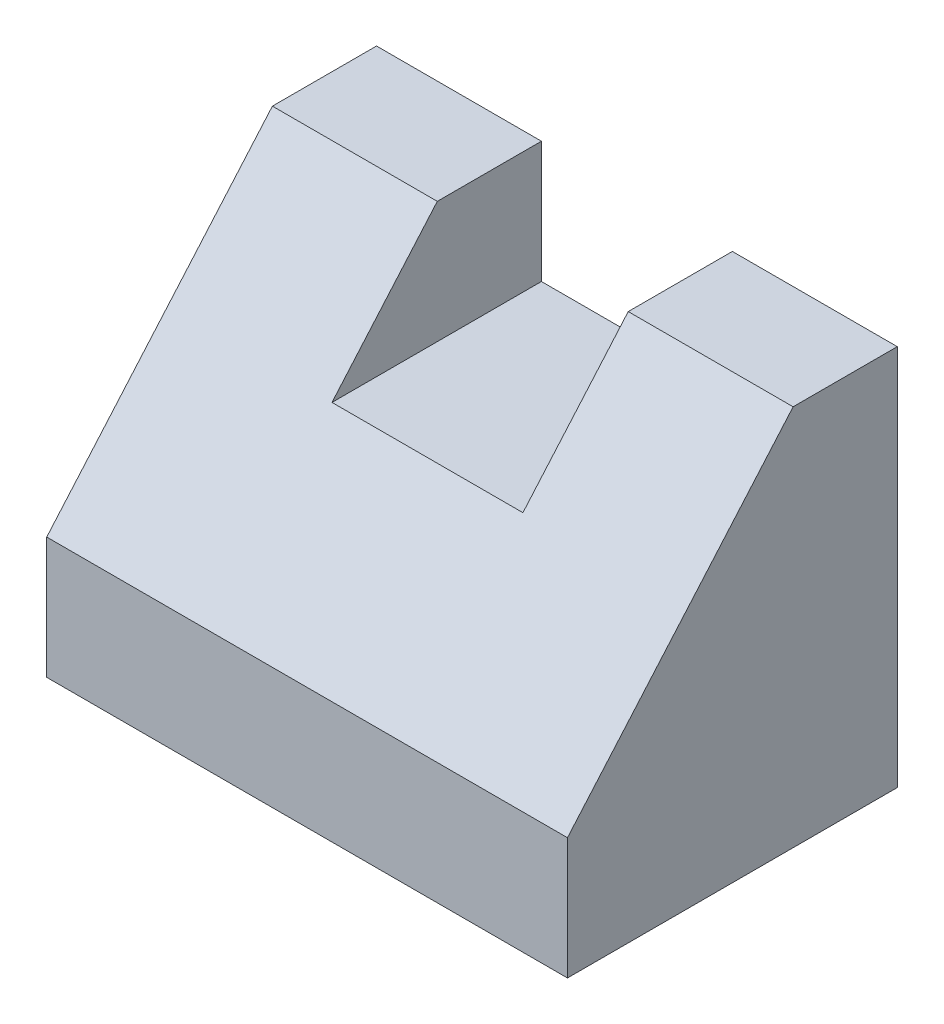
ISO-10303-21;
HEADER;
FILE_DESCRIPTION(('STEP AP214'),'2;1');
FILE_NAME('part.step','',(''),(''),'','','');
FILE_SCHEMA(('AUTOMOTIVE_DESIGN { 1 0 10303 214 1 1 1 1 }'));
ENDSEC;
DATA;
#1=APPLICATION_CONTEXT('core data for automotive mechanical design processes');
#2=APPLICATION_PROTOCOL_DEFINITION('international standard','automotive_design',2000,#1);
#3=PRODUCT_CONTEXT('',#1,'mechanical');
#4=PRODUCT('Part','Part','',(#3));
#5=PRODUCT_RELATED_PRODUCT_CATEGORY('part','',(#4));
#6=PRODUCT_DEFINITION_FORMATION('','',#4);
#7=PRODUCT_DEFINITION_CONTEXT('part definition',#1,'design');
#8=PRODUCT_DEFINITION('design','',#6,#7);
#9=PRODUCT_DEFINITION_SHAPE('','',#8);
#10=(LENGTH_UNIT() NAMED_UNIT(*) SI_UNIT(.MILLI.,.METRE.));
#11=(NAMED_UNIT(*) PLANE_ANGLE_UNIT() SI_UNIT($,.RADIAN.));
#12=(NAMED_UNIT(*) SI_UNIT($,.STERADIAN.) SOLID_ANGLE_UNIT());
#13=UNCERTAINTY_MEASURE_WITH_UNIT(LENGTH_MEASURE(1.E-05),#10,'distance_accuracy_value','');
#14=(GEOMETRIC_REPRESENTATION_CONTEXT(3) GLOBAL_UNCERTAINTY_ASSIGNED_CONTEXT((#13)) GLOBAL_UNIT_ASSIGNED_CONTEXT((#10,
#11,#12)) REPRESENTATION_CONTEXT('',''));
#15=CARTESIAN_POINT('',(0.,0.,0.));
#16=DIRECTION('',(0.,0.,1.));
#17=DIRECTION('',(1.,0.,0.));
#18=AXIS2_PLACEMENT_3D('',#15,#16,#17);
#19=CARTESIAN_POINT('',(15.,0.,6.));
#20=DIRECTION('',(0.,-1.,0.));
#21=DIRECTION('',(0.,0.,-1.));
#22=AXIS2_PLACEMENT_3D('',#19,#20,#21);
#23=PLANE('',#22);
#24=DIRECTION('',(-1.,0.,0.));
#25=VECTOR('',#24,1.);
#26=CARTESIAN_POINT('',(15.,0.,0.));
#27=LINE('',#26,#25);
#28=CARTESIAN_POINT('',(15.,0.,0.));
#29=VERTEX_POINT('',#28);
#30=CARTESIAN_POINT('',(5.5,0.,0.));
#31=VERTEX_POINT('',#30);
#32=EDGE_CURVE('E131',#29,#31,#27,.T.);
#33=ORIENTED_EDGE('',*,*,#32,.T.);
#34=DIRECTION('',(0.,0.,1.));
#35=VECTOR('',#34,1.);
#36=CARTESIAN_POINT('',(5.5,0.,6.));
#37=LINE('',#36,#35);
#38=CARTESIAN_POINT('',(5.5,0.,6.));
#39=VERTEX_POINT('',#38);
#40=EDGE_CURVE('E123',#31,#39,#37,.T.);
#41=ORIENTED_EDGE('',*,*,#40,.T.);
#42=DIRECTION('',(-1.,0.,0.));
#43=VECTOR('',#42,1.);
#44=CARTESIAN_POINT('',(15.,0.,6.));
#45=LINE('',#44,#43);
#46=CARTESIAN_POINT('',(15.,0.,6.));
#47=VERTEX_POINT('',#46);
#48=EDGE_CURVE('E39',#47,#39,#45,.T.);
#49=ORIENTED_EDGE('',*,*,#48,.F.);
#50=DIRECTION('',(0.,0.,1.));
#51=VECTOR('',#50,1.);
#52=CARTESIAN_POINT('',(15.,0.,6.));
#53=LINE('',#52,#51);
#54=EDGE_CURVE('E130',#29,#47,#53,.T.);
#55=ORIENTED_EDGE('',*,*,#54,.F.);
#56=EDGE_LOOP('',(#33,#41,#49,#55));
#57=FACE_BOUND('',#56,.T.);
#58=ADVANCED_FACE('F31',(#57),#23,.F.);
#59=CARTESIAN_POINT('',(-5.5,0.,6.));
#60=VERTEX_POINT('',#59);
#61=CARTESIAN_POINT('',(-15.,0.,6.));
#62=VERTEX_POINT('',#61);
#63=EDGE_CURVE('E135',#60,#62,#45,.T.);
#64=ORIENTED_EDGE('',*,*,#63,.F.);
#65=DIRECTION('',(0.,0.,-1.));
#66=VECTOR('',#65,1.);
#67=CARTESIAN_POINT('',(-5.5,0.,6.));
#68=LINE('',#67,#66);
#69=CARTESIAN_POINT('',(-5.5,0.,0.));
#70=VERTEX_POINT('',#69);
#71=EDGE_CURVE('E173',#60,#70,#68,.T.);
#72=ORIENTED_EDGE('',*,*,#71,.T.);
#73=CARTESIAN_POINT('',(-15.,0.,0.));
#74=VERTEX_POINT('',#73);
#75=EDGE_CURVE('E80',#70,#74,#27,.T.);
#76=ORIENTED_EDGE('',*,*,#75,.T.);
#77=DIRECTION('',(0.,0.,1.));
#78=VECTOR('',#77,1.);
#79=CARTESIAN_POINT('',(-15.,0.,6.));
#80=LINE('',#79,#78);
#81=EDGE_CURVE('E120',#74,#62,#80,.T.);
#82=ORIENTED_EDGE('',*,*,#81,.T.);
#83=EDGE_LOOP('',(#64,#72,#76,#82));
#84=FACE_BOUND('',#83,.T.);
#85=ADVANCED_FACE('F33',(#84),#23,.F.);
#86=CARTESIAN_POINT('',(15.,-15.,19.));
#87=DIRECTION('',(0.,-0.654930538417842,-0.755689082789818));
#88=DIRECTION('',(0.,0.755689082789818,-0.654930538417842));
#89=AXIS2_PLACEMENT_3D('',#86,#87,#88);
#90=PLANE('',#89);
#91=ORIENTED_EDGE('',*,*,#48,.T.);
#92=DIRECTION('',(0.,-0.755689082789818,0.654930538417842));
#93=VECTOR('',#92,1.);
#94=CARTESIAN_POINT('',(5.5,-15.,19.));
#95=LINE('',#94,#93);
#96=CARTESIAN_POINT('',(5.5,-7.,12.0666666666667));
#97=VERTEX_POINT('',#96);
#98=EDGE_CURVE('E171',#39,#97,#95,.T.);
#99=ORIENTED_EDGE('',*,*,#98,.T.);
#100=DIRECTION('',(-1.,0.,0.));
#101=VECTOR('',#100,1.);
#102=CARTESIAN_POINT('',(15.,-7.,12.0666666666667));
#103=LINE('',#102,#101);
#104=CARTESIAN_POINT('',(-5.5,-7.,12.0666666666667));
#105=VERTEX_POINT('',#104);
#106=EDGE_CURVE('E179',#97,#105,#103,.T.);
#107=ORIENTED_EDGE('',*,*,#106,.T.);
#108=DIRECTION('',(0.,0.755689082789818,-0.654930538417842));
#109=VECTOR('',#108,1.);
#110=CARTESIAN_POINT('',(-5.5,-15.,19.));
#111=LINE('',#110,#109);
#112=EDGE_CURVE('E145',#105,#60,#111,.T.);
#113=ORIENTED_EDGE('',*,*,#112,.T.);
#114=ORIENTED_EDGE('',*,*,#63,.T.);
#115=DIRECTION('',(0.,-0.755689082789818,0.654930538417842));
#116=VECTOR('',#115,1.);
#117=CARTESIAN_POINT('',(-15.,-15.,19.));
#118=LINE('',#117,#116);
#119=CARTESIAN_POINT('',(-15.,-15.,19.));
#120=VERTEX_POINT('',#119);
#121=EDGE_CURVE('E122',#62,#120,#118,.T.);
#122=ORIENTED_EDGE('',*,*,#121,.T.);
#123=DIRECTION('',(-1.,0.,0.));
#124=VECTOR('',#123,1.);
#125=CARTESIAN_POINT('',(15.,-15.,19.));
#126=LINE('',#125,#124);
#127=CARTESIAN_POINT('',(15.,-15.,19.));
#128=VERTEX_POINT('',#127);
#129=EDGE_CURVE('E111',#128,#120,#126,.T.);
#130=ORIENTED_EDGE('',*,*,#129,.F.);
#131=DIRECTION('',(0.,-0.755689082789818,0.654930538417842));
#132=VECTOR('',#131,1.);
#133=CARTESIAN_POINT('',(15.,-15.,19.));
#134=LINE('',#133,#132);
#135=EDGE_CURVE('E89',#47,#128,#134,.T.);
#136=ORIENTED_EDGE('',*,*,#135,.F.);
#137=EDGE_LOOP('',(#91,#99,#107,#113,#114,#122,#130,#136));
#138=FACE_BOUND('',#137,.T.);
#139=ADVANCED_FACE('F141',(#138),#90,.F.);
#140=CARTESIAN_POINT('',(15.,-22.,19.));
#141=DIRECTION('',(0.,0.,-1.));
#142=DIRECTION('',(0.,1.,0.));
#143=AXIS2_PLACEMENT_3D('',#140,#141,#142);
#144=PLANE('',#143);
#145=DIRECTION('',(0.,-1.,0.));
#146=VECTOR('',#145,1.);
#147=CARTESIAN_POINT('',(-15.,-22.,19.));
#148=LINE('',#147,#146);
#149=CARTESIAN_POINT('',(-15.,-22.,19.));
#150=VERTEX_POINT('',#149);
#151=EDGE_CURVE('E108',#120,#150,#148,.T.);
#152=ORIENTED_EDGE('',*,*,#151,.T.);
#153=DIRECTION('',(-1.,0.,0.));
#154=VECTOR('',#153,1.);
#155=CARTESIAN_POINT('',(15.,-22.,19.));
#156=LINE('',#155,#154);
#157=CARTESIAN_POINT('',(15.,-22.,19.));
#158=VERTEX_POINT('',#157);
#159=EDGE_CURVE('E105',#158,#150,#156,.T.);
#160=ORIENTED_EDGE('',*,*,#159,.F.);
#161=DIRECTION('',(0.,-1.,0.));
#162=VECTOR('',#161,1.);
#163=CARTESIAN_POINT('',(15.,-22.,19.));
#164=LINE('',#163,#162);
#165=EDGE_CURVE('E95',#128,#158,#164,.T.);
#166=ORIENTED_EDGE('',*,*,#165,.F.);
#167=ORIENTED_EDGE('',*,*,#129,.T.);
#168=EDGE_LOOP('',(#152,#160,#166,#167));
#169=FACE_BOUND('',#168,.T.);
#170=ADVANCED_FACE('F106',(#169),#144,.F.);
#171=CARTESIAN_POINT('',(15.,-22.,0.));
#172=DIRECTION('',(0.,1.,0.));
#173=DIRECTION('',(0.,0.,1.));
#174=AXIS2_PLACEMENT_3D('',#171,#172,#173);
#175=PLANE('',#174);
#176=DIRECTION('',(0.,0.,-1.));
#177=VECTOR('',#176,1.);
#178=CARTESIAN_POINT('',(-15.,-22.,0.));
#179=LINE('',#178,#177);
#180=CARTESIAN_POINT('',(-15.,-22.,0.));
#181=VERTEX_POINT('',#180);
#182=EDGE_CURVE('E126',#150,#181,#179,.T.);
#183=ORIENTED_EDGE('',*,*,#182,.T.);
#184=DIRECTION('',(-1.,0.,0.));
#185=VECTOR('',#184,1.);
#186=CARTESIAN_POINT('',(15.,-22.,0.));
#187=LINE('',#186,#185);
#188=CARTESIAN_POINT('',(15.,-22.,0.));
#189=VERTEX_POINT('',#188);
#190=EDGE_CURVE('E112',#189,#181,#187,.T.);
#191=ORIENTED_EDGE('',*,*,#190,.F.);
#192=DIRECTION('',(0.,0.,-1.));
#193=VECTOR('',#192,1.);
#194=CARTESIAN_POINT('',(15.,-22.,0.));
#195=LINE('',#194,#193);
#196=EDGE_CURVE('E99',#158,#189,#195,.T.);
#197=ORIENTED_EDGE('',*,*,#196,.F.);
#198=ORIENTED_EDGE('',*,*,#159,.T.);
#199=EDGE_LOOP('',(#183,#191,#197,#198));
#200=FACE_BOUND('',#199,.T.);
#201=ADVANCED_FACE('F114',(#200),#175,.F.);
#202=CARTESIAN_POINT('',(15.,0.,0.));
#203=DIRECTION('',(0.,0.,1.));
#204=DIRECTION('',(0.,-1.,0.));
#205=AXIS2_PLACEMENT_3D('',#202,#203,#204);
#206=PLANE('',#205);
#207=DIRECTION('',(-1.,0.,0.));
#208=VECTOR('',#207,1.);
#209=CARTESIAN_POINT('',(5.5,-7.,0.));
#210=LINE('',#209,#208);
#211=CARTESIAN_POINT('',(5.5,-7.,0.));
#212=VERTEX_POINT('',#211);
#213=CARTESIAN_POINT('',(-5.5,-7.,0.));
#214=VERTEX_POINT('',#213);
#215=EDGE_CURVE('E166',#212,#214,#210,.T.);
#216=ORIENTED_EDGE('',*,*,#215,.F.);
#217=DIRECTION('',(0.,1.,0.));
#218=VECTOR('',#217,1.);
#219=CARTESIAN_POINT('',(5.5,0.,0.));
#220=LINE('',#219,#218);
#221=EDGE_CURVE('E11',#212,#31,#220,.T.);
#222=ORIENTED_EDGE('',*,*,#221,.T.);
#223=ORIENTED_EDGE('',*,*,#32,.F.);
#224=DIRECTION('',(0.,1.,0.));
#225=VECTOR('',#224,1.);
#226=CARTESIAN_POINT('',(15.,0.,0.));
#227=LINE('',#226,#225);
#228=EDGE_CURVE('E55',#189,#29,#227,.T.);
#229=ORIENTED_EDGE('',*,*,#228,.F.);
#230=ORIENTED_EDGE('',*,*,#190,.T.);
#231=DIRECTION('',(0.,1.,0.));
#232=VECTOR('',#231,1.);
#233=CARTESIAN_POINT('',(-15.,0.,0.));
#234=LINE('',#233,#232);
#235=EDGE_CURVE('E128',#181,#74,#234,.T.);
#236=ORIENTED_EDGE('',*,*,#235,.T.);
#237=ORIENTED_EDGE('',*,*,#75,.F.);
#238=DIRECTION('',(0.,1.,0.));
#239=VECTOR('',#238,1.);
#240=CARTESIAN_POINT('',(-5.5,2.26628352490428,0.));
#241=LINE('',#240,#239);
#242=EDGE_CURVE('E183',#214,#70,#241,.T.);
#243=ORIENTED_EDGE('',*,*,#242,.F.);
#244=EDGE_LOOP('',(#216,#222,#223,#229,#230,#236,#237,#243));
#245=FACE_BOUND('',#244,.T.);
#246=ADVANCED_FACE('F164',(#245),#206,.F.);
#247=CARTESIAN_POINT('',(15.,0.,0.));
#248=DIRECTION('',(-1.,0.,0.));
#249=DIRECTION('',(0.,0.,1.));
#250=AXIS2_PLACEMENT_3D('',#247,#248,#249);
#251=PLANE('',#250);
#252=ORIENTED_EDGE('',*,*,#54,.T.);
#253=ORIENTED_EDGE('',*,*,#135,.T.);
#254=ORIENTED_EDGE('',*,*,#165,.T.);
#255=ORIENTED_EDGE('',*,*,#196,.T.);
#256=ORIENTED_EDGE('',*,*,#228,.T.);
#257=EDGE_LOOP('',(#252,#253,#254,#255,#256));
#258=FACE_BOUND('',#257,.T.);
#259=ADVANCED_FACE('F97',(#258),#251,.F.);
#260=CARTESIAN_POINT('',(-15.,0.,0.));
#261=DIRECTION('',(-1.,0.,0.));
#262=DIRECTION('',(0.,0.,1.));
#263=AXIS2_PLACEMENT_3D('',#260,#261,#262);
#264=PLANE('',#263);
#265=ORIENTED_EDGE('',*,*,#81,.F.);
#266=ORIENTED_EDGE('',*,*,#235,.F.);
#267=ORIENTED_EDGE('',*,*,#182,.F.);
#268=ORIENTED_EDGE('',*,*,#151,.F.);
#269=ORIENTED_EDGE('',*,*,#121,.F.);
#270=EDGE_LOOP('',(#265,#266,#267,#268,#269));
#271=FACE_BOUND('',#270,.T.);
#272=ADVANCED_FACE('F148',(#271),#264,.T.);
#273=CARTESIAN_POINT('',(5.5,2.26628352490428,30.));
#274=DIRECTION('',(1.,0.,0.));
#275=DIRECTION('',(0.,1.,0.));
#276=AXIS2_PLACEMENT_3D('',#273,#274,#275);
#277=PLANE('',#276);
#278=ORIENTED_EDGE('',*,*,#221,.F.);
#279=DIRECTION('',(0.,0.,-1.));
#280=VECTOR('',#279,1.);
#281=CARTESIAN_POINT('',(5.5,-7.,30.));
#282=LINE('',#281,#280);
#283=EDGE_CURVE('E46',#97,#212,#282,.T.);
#284=ORIENTED_EDGE('',*,*,#283,.F.);
#285=ORIENTED_EDGE('',*,*,#98,.F.);
#286=ORIENTED_EDGE('',*,*,#40,.F.);
#287=EDGE_LOOP('',(#278,#284,#285,#286));
#288=FACE_BOUND('',#287,.T.);
#289=ADVANCED_FACE('F168',(#288),#277,.F.);
#290=CARTESIAN_POINT('',(-5.5,2.26628352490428,30.));
#291=DIRECTION('',(-1.,0.,0.));
#292=DIRECTION('',(0.,-1.,0.));
#293=AXIS2_PLACEMENT_3D('',#290,#291,#292);
#294=PLANE('',#293);
#295=ORIENTED_EDGE('',*,*,#112,.F.);
#296=DIRECTION('',(0.,0.,-1.));
#297=VECTOR('',#296,1.);
#298=CARTESIAN_POINT('',(-5.5,-7.,30.));
#299=LINE('',#298,#297);
#300=EDGE_CURVE('E181',#105,#214,#299,.T.);
#301=ORIENTED_EDGE('',*,*,#300,.T.);
#302=ORIENTED_EDGE('',*,*,#242,.T.);
#303=ORIENTED_EDGE('',*,*,#71,.F.);
#304=EDGE_LOOP('',(#295,#301,#302,#303));
#305=FACE_BOUND('',#304,.T.);
#306=ADVANCED_FACE('F196',(#305),#294,.F.);
#307=CARTESIAN_POINT('',(5.5,-7.,30.));
#308=DIRECTION('',(0.,-1.,0.));
#309=DIRECTION('',(0.,0.,-1.));
#310=AXIS2_PLACEMENT_3D('',#307,#308,#309);
#311=PLANE('',#310);
#312=ORIENTED_EDGE('',*,*,#283,.T.);
#313=ORIENTED_EDGE('',*,*,#215,.T.);
#314=ORIENTED_EDGE('',*,*,#300,.F.);
#315=ORIENTED_EDGE('',*,*,#106,.F.);
#316=EDGE_LOOP('',(#312,#313,#314,#315));
#317=FACE_BOUND('',#316,.T.);
#318=ADVANCED_FACE('F190',(#317),#311,.F.);
#319=CLOSED_SHELL('',(#58,#85,#139,#170,#201,#246,#259,#272,#289,#306,#318));
#320=MANIFOLD_SOLID_BREP('B2',#319);
#321=ADVANCED_BREP_SHAPE_REPRESENTATION('',(#18,#320),#14);
#322=SHAPE_DEFINITION_REPRESENTATION(#9,#321);
ENDSEC;
END-ISO-10303-21;
